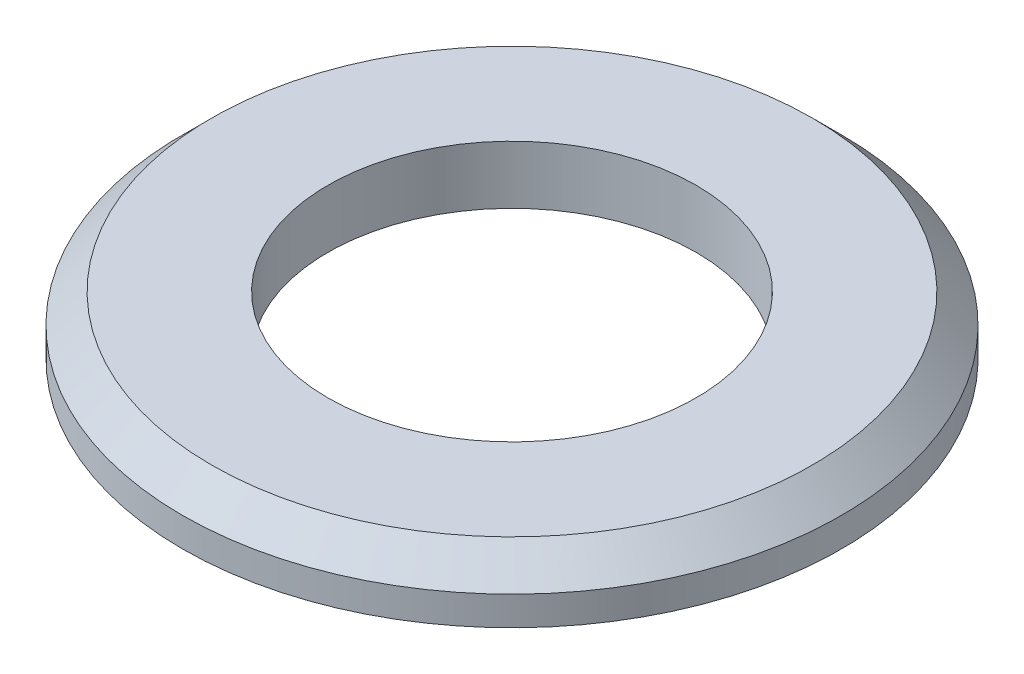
from build123d import *

# Parameters (mm, degrees)
SKETCH1_R      = 17
SKETCH1_R_2    = 9.5
EXTRUDE1_DEPTH = 3
CHAMFER1_SIZE  = 1.5


with BuildPart() as part:
    # Sketch1 → Extrude1 (new body)
    with BuildSketch(Plane(origin=(0, 0, 0), x_dir=(1, 0, 0), z_dir=(0, 1, 0))):
        with Locations(Location((0, 0, 0), (0, 0, 270))):
            Circle(SKETCH1_R)
        with Locations(Location((0, 0, 0), (0, 0, 270))):
            Circle(SKETCH1_R_2, mode=Mode.SUBTRACT)
    extrude(amount=EXTRUDE1_DEPTH)

    # Chamfer1
    chamfer1_edges = [part.edges().sort_by_distance(p)[0] for p in [
        (0, 3, -17),
    ]]
    chamfer(chamfer1_edges, length=CHAMFER1_SIZE)


solid = part.part
